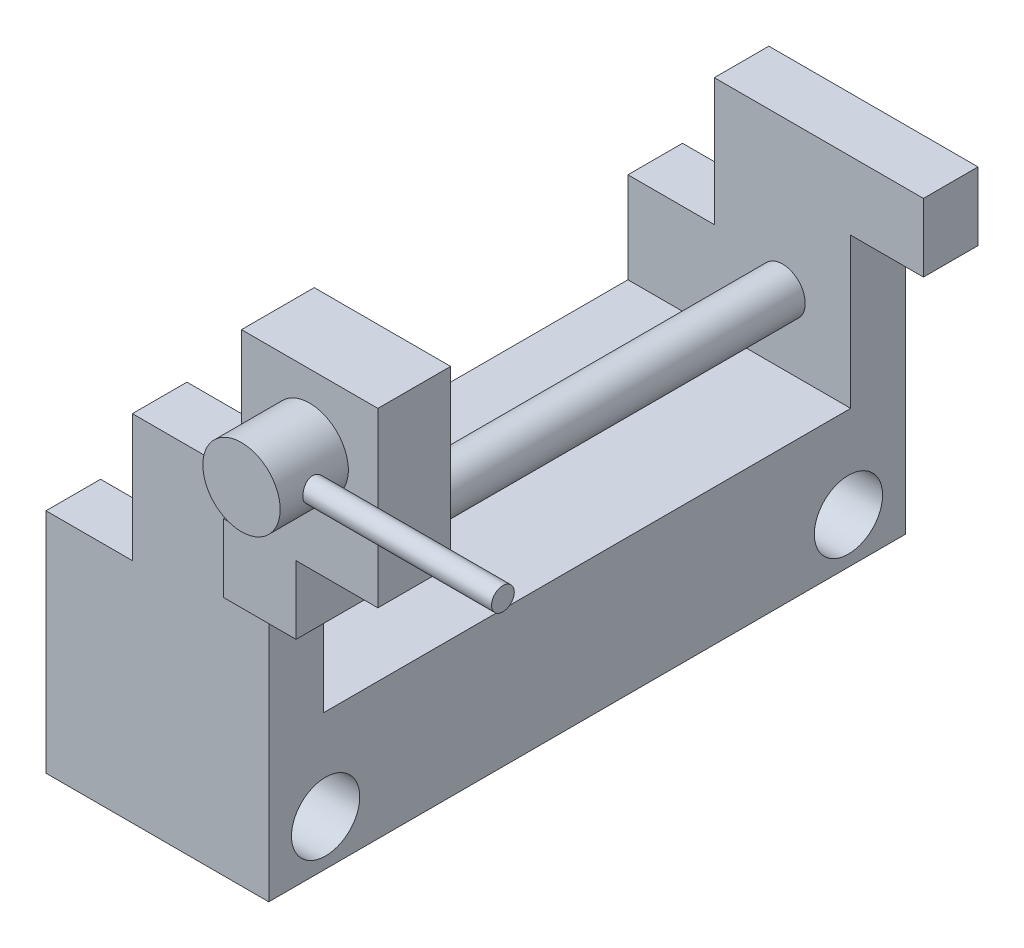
ISO-10303-21;
HEADER;
FILE_DESCRIPTION(('STEP AP214'),'2;1');
FILE_NAME('part.step','',(''),(''),'','','');
FILE_SCHEMA(('AUTOMOTIVE_DESIGN { 1 0 10303 214 1 1 1 1 }'));
ENDSEC;
DATA;
#1=APPLICATION_CONTEXT('core data for automotive mechanical design processes');
#2=APPLICATION_PROTOCOL_DEFINITION('international standard','automotive_design',2000,#1);
#3=PRODUCT_CONTEXT('',#1,'mechanical');
#4=PRODUCT('Part','Part','',(#3));
#5=PRODUCT_RELATED_PRODUCT_CATEGORY('part','',(#4));
#6=PRODUCT_DEFINITION_FORMATION('','',#4);
#7=PRODUCT_DEFINITION_CONTEXT('part definition',#1,'design');
#8=PRODUCT_DEFINITION('design','',#6,#7);
#9=PRODUCT_DEFINITION_SHAPE('','',#8);
#10=(LENGTH_UNIT() NAMED_UNIT(*) SI_UNIT(.MILLI.,.METRE.));
#11=(NAMED_UNIT(*) PLANE_ANGLE_UNIT() SI_UNIT($,.RADIAN.));
#12=(NAMED_UNIT(*) SI_UNIT($,.STERADIAN.) SOLID_ANGLE_UNIT());
#13=UNCERTAINTY_MEASURE_WITH_UNIT(LENGTH_MEASURE(1.E-05),#10,'distance_accuracy_value','');
#14=(GEOMETRIC_REPRESENTATION_CONTEXT(3) GLOBAL_UNCERTAINTY_ASSIGNED_CONTEXT((#13)) GLOBAL_UNIT_ASSIGNED_CONTEXT((#10,
#11,#12)) REPRESENTATION_CONTEXT('',''));
#15=CARTESIAN_POINT('',(0.,0.,0.));
#16=DIRECTION('',(0.,0.,1.));
#17=DIRECTION('',(1.,0.,0.));
#18=AXIS2_PLACEMENT_3D('',#15,#16,#17);
#19=CARTESIAN_POINT('',(-26.8554201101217,3.55207276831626,57.2035545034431));
#20=DIRECTION('',(0.,0.,-1.));
#21=DIRECTION('',(-1.,0.,0.));
#22=AXIS2_PLACEMENT_3D('',#19,#20,#21);
#23=PLANE('',#22);
#24=DIRECTION('',(0.,-1.,0.));
#25=VECTOR('',#24,1.);
#26=CARTESIAN_POINT('',(22.1445798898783,36.5520727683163,57.2035545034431));
#27=LINE('',#26,#25);
#28=CARTESIAN_POINT('',(22.1445798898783,51.5520727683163,57.2035545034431));
#29=VERTEX_POINT('',#28);
#30=CARTESIAN_POINT('',(22.1445798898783,36.5520727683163,57.2035545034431));
#31=VERTEX_POINT('',#30);
#32=EDGE_CURVE('E1438',#29,#31,#27,.T.);
#33=ORIENTED_EDGE('',*,*,#32,.F.);
#34=DIRECTION('',(1.,0.,0.));
#35=VECTOR('',#34,1.);
#36=CARTESIAN_POINT('',(22.1445798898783,51.5520727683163,57.2035545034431));
#37=LINE('',#36,#35);
#38=CARTESIAN_POINT('',(-7.85542011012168,51.5520727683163,57.2035545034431));
#39=VERTEX_POINT('',#38);
#40=EDGE_CURVE('E1504',#39,#29,#37,.T.);
#41=ORIENTED_EDGE('',*,*,#40,.F.);
#42=DIRECTION('',(0.,-1.,0.));
#43=VECTOR('',#42,1.);
#44=CARTESIAN_POINT('',(-7.85542011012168,51.5520727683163,57.2035545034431));
#45=LINE('',#44,#43);
#46=CARTESIAN_POINT('',(-7.85542011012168,23.5520727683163,57.2035545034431));
#47=VERTEX_POINT('',#46);
#48=EDGE_CURVE('E1507',#39,#47,#45,.T.);
#49=ORIENTED_EDGE('',*,*,#48,.T.);
#50=DIRECTION('',(1.,0.,0.));
#51=VECTOR('',#50,1.);
#52=CARTESIAN_POINT('',(-26.8554201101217,23.5520727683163,57.2035545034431));
#53=LINE('',#52,#51);
#54=CARTESIAN_POINT('',(-26.8554201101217,23.5520727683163,57.2035545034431));
#55=VERTEX_POINT('',#54);
#56=EDGE_CURVE('E1534',#55,#47,#53,.T.);
#57=ORIENTED_EDGE('',*,*,#56,.F.);
#58=DIRECTION('',(0.,-1.,0.));
#59=VECTOR('',#58,1.);
#60=CARTESIAN_POINT('',(-26.8554201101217,3.55207276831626,57.2035545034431));
#61=LINE('',#60,#59);
#62=CARTESIAN_POINT('',(-26.8554201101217,-26.4479272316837,57.2035545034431));
#63=VERTEX_POINT('',#62);
#64=EDGE_CURVE('E1568',#55,#63,#61,.T.);
#65=ORIENTED_EDGE('',*,*,#64,.T.);
#66=DIRECTION('',(1.,0.,0.));
#67=VECTOR('',#66,1.);
#68=CARTESIAN_POINT('',(-26.8554201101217,-26.4479272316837,57.2035545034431));
#69=LINE('',#68,#67);
#70=CARTESIAN_POINT('',(22.1445798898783,-26.4479272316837,57.2035545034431));
#71=VERTEX_POINT('',#70);
#72=EDGE_CURVE('E1555',#63,#71,#69,.T.);
#73=ORIENTED_EDGE('',*,*,#72,.T.);
#74=DIRECTION('',(0.,-1.,0.));
#75=VECTOR('',#74,1.);
#76=CARTESIAN_POINT('',(22.1445798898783,3.55207276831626,57.2035545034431));
#77=LINE('',#76,#75);
#78=EDGE_CURVE('E1566',#31,#71,#77,.T.);
#79=ORIENTED_EDGE('',*,*,#78,.F.);
#80=EDGE_LOOP('',(#33,#41,#49,#57,#65,#73,#79));
#81=FACE_BOUND('',#80,.T.);
#82=ADVANCED_FACE('F1240',(#81),#23,.F.);
#83=CARTESIAN_POINT('',(22.1445798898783,3.55207276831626,57.2035545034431));
#84=DIRECTION('',(-1.,0.,0.));
#85=DIRECTION('',(0.,0.,1.));
#86=AXIS2_PLACEMENT_3D('',#83,#84,#85);
#87=PLANE('',#86);
#88=CARTESIAN_POINT('',(22.1445798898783,-16.4479272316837,44.7035545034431));
#89=DIRECTION('',(1.,0.,0.));
#90=DIRECTION('',(0.,0.,-1.));
#91=AXIS2_PLACEMENT_3D('',#88,#89,#90);
#92=CIRCLE('',#91,7.505);
#93=CARTESIAN_POINT('',(22.1445798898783,-16.4479272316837,37.1985545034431));
#94=VERTEX_POINT('',#93);
#95=EDGE_CURVE('E1771',#94,#94,#92,.T.);
#96=ORIENTED_EDGE('',*,*,#95,.F.);
#97=EDGE_LOOP('',(#96));
#98=FACE_BOUND('',#97,.T.);
#99=CARTESIAN_POINT('',(22.1445798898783,-16.4479272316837,-70.2964454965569));
#100=DIRECTION('',(1.,0.,0.));
#101=DIRECTION('',(0.,0.,-1.));
#102=AXIS2_PLACEMENT_3D('',#99,#100,#101);
#103=CIRCLE('',#102,7.505);
#104=CARTESIAN_POINT('',(22.1445798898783,-16.4479272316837,-77.8014454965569));
#105=VERTEX_POINT('',#104);
#106=EDGE_CURVE('E1780',#105,#105,#103,.T.);
#107=ORIENTED_EDGE('',*,*,#106,.F.);
#108=EDGE_LOOP('',(#107));
#109=FACE_BOUND('',#108,.T.);
#110=DIRECTION('',(0.,0.,-1.));
#111=VECTOR('',#110,1.);
#112=CARTESIAN_POINT('',(22.1445798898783,36.5520727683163,-70.7964454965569));
#113=LINE('',#112,#111);
#114=CARTESIAN_POINT('',(22.1445798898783,36.5520727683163,-70.7964454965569));
#115=VERTEX_POINT('',#114);
#116=CARTESIAN_POINT('',(22.1445798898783,36.5520727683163,-82.7964454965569));
#117=VERTEX_POINT('',#116);
#118=EDGE_CURVE('E1453',#115,#117,#113,.T.);
#119=ORIENTED_EDGE('',*,*,#118,.F.);
#120=DIRECTION('',(0.,-1.,0.));
#121=VECTOR('',#120,1.);
#122=CARTESIAN_POINT('',(22.1445798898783,23.5520727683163,-70.7964454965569));
#123=LINE('',#122,#121);
#124=CARTESIAN_POINT('',(22.1445798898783,3.55207276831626,-70.7964454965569));
#125=VERTEX_POINT('',#124);
#126=EDGE_CURVE('E1523',#115,#125,#123,.T.);
#127=ORIENTED_EDGE('',*,*,#126,.T.);
#128=DIRECTION('',(0.,0.,-1.));
#129=VECTOR('',#128,1.);
#130=CARTESIAN_POINT('',(22.1445798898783,3.55207276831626,57.2035545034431));
#131=LINE('',#130,#129);
#132=CARTESIAN_POINT('',(22.1445798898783,3.55207276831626,45.2035545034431));
#133=VERTEX_POINT('',#132);
#134=EDGE_CURVE('E1548',#133,#125,#131,.T.);
#135=ORIENTED_EDGE('',*,*,#134,.F.);
#136=DIRECTION('',(0.,-1.,0.));
#137=VECTOR('',#136,1.);
#138=CARTESIAN_POINT('',(22.1445798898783,23.5520727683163,45.2035545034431));
#139=LINE('',#138,#137);
#140=CARTESIAN_POINT('',(22.1445798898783,36.5520727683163,45.2035545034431));
#141=VERTEX_POINT('',#140);
#142=EDGE_CURVE('E1543',#141,#133,#139,.T.);
#143=ORIENTED_EDGE('',*,*,#142,.F.);
#144=DIRECTION('',(0.,0.,-1.));
#145=VECTOR('',#144,1.);
#146=CARTESIAN_POINT('',(22.1445798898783,36.5520727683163,57.2035545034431));
#147=LINE('',#146,#145);
#148=EDGE_CURVE('E1471',#31,#141,#147,.T.);
#149=ORIENTED_EDGE('',*,*,#148,.F.);
#150=ORIENTED_EDGE('',*,*,#78,.T.);
#151=DIRECTION('',(0.,0.,-1.));
#152=VECTOR('',#151,1.);
#153=CARTESIAN_POINT('',(22.1445798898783,-26.4479272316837,57.2035545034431));
#154=LINE('',#153,#152);
#155=CARTESIAN_POINT('',(22.1445798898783,-26.4479272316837,-82.7964454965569));
#156=VERTEX_POINT('',#155);
#157=EDGE_CURVE('E1558',#71,#156,#154,.T.);
#158=ORIENTED_EDGE('',*,*,#157,.T.);
#159=DIRECTION('',(0.,-1.,0.));
#160=VECTOR('',#159,1.);
#161=CARTESIAN_POINT('',(22.1445798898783,3.55207276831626,-82.7964454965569));
#162=LINE('',#161,#160);
#163=EDGE_CURVE('E1564',#117,#156,#162,.T.);
#164=ORIENTED_EDGE('',*,*,#163,.F.);
#165=EDGE_LOOP('',(#119,#127,#135,#143,#149,#150,#158,#164));
#166=FACE_BOUND('',#165,.T.);
#167=ADVANCED_FACE('F1604',(#98,#109,#166),#87,.F.);
#168=CARTESIAN_POINT('',(-26.8554201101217,23.5520727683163,57.2035545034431));
#169=DIRECTION('',(0.,1.,0.));
#170=DIRECTION('',(0.,0.,1.));
#171=AXIS2_PLACEMENT_3D('',#168,#169,#170);
#172=PLANE('',#171);
#173=DIRECTION('',(1.,0.,0.));
#174=VECTOR('',#173,1.);
#175=CARTESIAN_POINT('',(-26.8554201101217,23.5520727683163,-70.7964454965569));
#176=LINE('',#175,#174);
#177=CARTESIAN_POINT('',(-26.8554201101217,23.5520727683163,-70.7964454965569));
#178=VERTEX_POINT('',#177);
#179=CARTESIAN_POINT('',(-7.85542011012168,23.5520727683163,-70.7964454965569));
#180=VERTEX_POINT('',#179);
#181=EDGE_CURVE('E1519',#178,#180,#176,.T.);
#182=ORIENTED_EDGE('',*,*,#181,.T.);
#183=DIRECTION('',(0.,0.,1.));
#184=VECTOR('',#183,1.);
#185=CARTESIAN_POINT('',(-7.85542011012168,23.5520727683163,-70.7964454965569));
#186=LINE('',#185,#184);
#187=CARTESIAN_POINT('',(-7.85542011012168,23.5520727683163,-82.7964454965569));
#188=VERTEX_POINT('',#187);
#189=EDGE_CURVE('E1484',#188,#180,#186,.T.);
#190=ORIENTED_EDGE('',*,*,#189,.F.);
#191=DIRECTION('',(-1.,0.,0.));
#192=VECTOR('',#191,1.);
#193=CARTESIAN_POINT('',(-26.8554201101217,23.5520727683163,-82.7964454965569));
#194=LINE('',#193,#192);
#195=CARTESIAN_POINT('',(-26.8554201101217,23.5520727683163,-82.7964454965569));
#196=VERTEX_POINT('',#195);
#197=EDGE_CURVE('E1521',#188,#196,#194,.T.);
#198=ORIENTED_EDGE('',*,*,#197,.T.);
#199=DIRECTION('',(0.,0.,1.));
#200=VECTOR('',#199,1.);
#201=CARTESIAN_POINT('',(-26.8554201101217,23.5520727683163,-82.7964454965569));
#202=LINE('',#201,#200);
#203=EDGE_CURVE('E1516',#196,#178,#202,.T.);
#204=ORIENTED_EDGE('',*,*,#203,.T.);
#205=EDGE_LOOP('',(#182,#190,#198,#204));
#206=FACE_BOUND('',#205,.T.);
#207=ADVANCED_FACE('F1609',(#206),#172,.T.);
#208=CARTESIAN_POINT('',(-26.8554201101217,23.5520727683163,57.2035545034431));
#209=DIRECTION('',(0.,-1.,0.));
#210=DIRECTION('',(0.,0.,-1.));
#211=AXIS2_PLACEMENT_3D('',#208,#209,#210);
#212=PLANE('',#211);
#213=DIRECTION('',(0.,0.,1.));
#214=VECTOR('',#213,1.);
#215=CARTESIAN_POINT('',(-7.85542011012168,23.5520727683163,57.2035545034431));
#216=LINE('',#215,#214);
#217=CARTESIAN_POINT('',(-7.85542011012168,23.5520727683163,45.2035545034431));
#218=VERTEX_POINT('',#217);
#219=EDGE_CURVE('E1499',#218,#47,#216,.T.);
#220=ORIENTED_EDGE('',*,*,#219,.F.);
#221=DIRECTION('',(-1.,0.,0.));
#222=VECTOR('',#221,1.);
#223=CARTESIAN_POINT('',(-26.8554201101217,23.5520727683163,45.2035545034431));
#224=LINE('',#223,#222);
#225=CARTESIAN_POINT('',(-26.8554201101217,23.5520727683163,45.2035545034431));
#226=VERTEX_POINT('',#225);
#227=EDGE_CURVE('E1536',#218,#226,#224,.T.);
#228=ORIENTED_EDGE('',*,*,#227,.T.);
#229=DIRECTION('',(0.,0.,1.));
#230=VECTOR('',#229,1.);
#231=CARTESIAN_POINT('',(-26.8554201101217,23.5520727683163,57.2035545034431));
#232=LINE('',#231,#230);
#233=EDGE_CURVE('E1531',#226,#55,#232,.T.);
#234=ORIENTED_EDGE('',*,*,#233,.T.);
#235=ORIENTED_EDGE('',*,*,#56,.T.);
#236=EDGE_LOOP('',(#220,#228,#234,#235));
#237=FACE_BOUND('',#236,.T.);
#238=ADVANCED_FACE('F1625',(#237),#212,.F.);
#239=CARTESIAN_POINT('',(-26.8554201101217,3.55207276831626,57.2035545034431));
#240=DIRECTION('',(0.,-1.,0.));
#241=DIRECTION('',(0.,0.,-1.));
#242=AXIS2_PLACEMENT_3D('',#239,#240,#241);
#243=PLANE('',#242);
#244=DIRECTION('',(1.,0.,0.));
#245=VECTOR('',#244,1.);
#246=CARTESIAN_POINT('',(-26.8554201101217,3.55207276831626,-70.7964454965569));
#247=LINE('',#246,#245);
#248=CARTESIAN_POINT('',(-26.8554201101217,3.55207276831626,-70.7964454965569));
#249=VERTEX_POINT('',#248);
#250=EDGE_CURVE('E1515',#249,#125,#247,.T.);
#251=ORIENTED_EDGE('',*,*,#250,.F.);
#252=DIRECTION('',(0.,0.,1.));
#253=VECTOR('',#252,1.);
#254=CARTESIAN_POINT('',(-26.8554201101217,3.55207276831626,57.2035545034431));
#255=LINE('',#254,#253);
#256=CARTESIAN_POINT('',(-26.8554201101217,3.55207276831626,45.2035545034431));
#257=VERTEX_POINT('',#256);
#258=EDGE_CURVE('E1546',#249,#257,#255,.T.);
#259=ORIENTED_EDGE('',*,*,#258,.T.);
#260=DIRECTION('',(-1.,0.,0.));
#261=VECTOR('',#260,1.);
#262=CARTESIAN_POINT('',(-26.8554201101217,3.55207276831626,45.2035545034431));
#263=LINE('',#262,#261);
#264=EDGE_CURVE('E1530',#133,#257,#263,.T.);
#265=ORIENTED_EDGE('',*,*,#264,.F.);
#266=ORIENTED_EDGE('',*,*,#134,.T.);
#267=EDGE_LOOP('',(#251,#259,#265,#266));
#268=FACE_BOUND('',#267,.T.);
#269=ADVANCED_FACE('F1622',(#268),#243,.F.);
#270=CARTESIAN_POINT('',(-26.8554201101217,3.55207276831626,57.2035545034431));
#271=DIRECTION('',(1.,0.,0.));
#272=DIRECTION('',(0.,0.,-1.));
#273=AXIS2_PLACEMENT_3D('',#270,#271,#272);
#274=PLANE('',#273);
#275=CARTESIAN_POINT('',(-26.8554201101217,-16.4479272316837,44.7035545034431));
#276=DIRECTION('',(1.,0.,0.));
#277=DIRECTION('',(0.,0.,-1.));
#278=AXIS2_PLACEMENT_3D('',#275,#276,#277);
#279=CIRCLE('',#278,7.505);
#280=CARTESIAN_POINT('',(-26.8554201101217,-16.4479272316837,37.1985545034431));
#281=VERTEX_POINT('',#280);
#282=EDGE_CURVE('E1244',#281,#281,#279,.T.);
#283=ORIENTED_EDGE('',*,*,#282,.T.);
#284=EDGE_LOOP('',(#283));
#285=FACE_BOUND('',#284,.T.);
#286=CARTESIAN_POINT('',(-26.8554201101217,-16.4479272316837,-70.2964454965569));
#287=DIRECTION('',(1.,0.,0.));
#288=DIRECTION('',(0.,0.,-1.));
#289=AXIS2_PLACEMENT_3D('',#286,#287,#288);
#290=CIRCLE('',#289,7.505);
#291=CARTESIAN_POINT('',(-26.8554201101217,-16.4479272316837,-77.8014454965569));
#292=VERTEX_POINT('',#291);
#293=EDGE_CURVE('E1774',#292,#292,#290,.T.);
#294=ORIENTED_EDGE('',*,*,#293,.T.);
#295=EDGE_LOOP('',(#294));
#296=FACE_BOUND('',#295,.T.);
#297=DIRECTION('',(0.,0.,1.));
#298=VECTOR('',#297,1.);
#299=CARTESIAN_POINT('',(-26.8554201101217,-26.4479272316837,57.2035545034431));
#300=LINE('',#299,#298);
#301=CARTESIAN_POINT('',(-26.8554201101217,-26.4479272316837,-82.7964454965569));
#302=VERTEX_POINT('',#301);
#303=EDGE_CURVE('E1545',#302,#63,#300,.T.);
#304=ORIENTED_EDGE('',*,*,#303,.T.);
#305=ORIENTED_EDGE('',*,*,#64,.F.);
#306=ORIENTED_EDGE('',*,*,#233,.F.);
#307=DIRECTION('',(0.,-1.,0.));
#308=VECTOR('',#307,1.);
#309=CARTESIAN_POINT('',(-26.8554201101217,23.5520727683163,45.2035545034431));
#310=LINE('',#309,#308);
#311=EDGE_CURVE('E1538',#226,#257,#310,.T.);
#312=ORIENTED_EDGE('',*,*,#311,.T.);
#313=ORIENTED_EDGE('',*,*,#258,.F.);
#314=DIRECTION('',(0.,-1.,0.));
#315=VECTOR('',#314,1.);
#316=CARTESIAN_POINT('',(-26.8554201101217,23.5520727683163,-70.7964454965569));
#317=LINE('',#316,#315);
#318=EDGE_CURVE('E1527',#178,#249,#317,.T.);
#319=ORIENTED_EDGE('',*,*,#318,.F.);
#320=ORIENTED_EDGE('',*,*,#203,.F.);
#321=DIRECTION('',(0.,-1.,0.));
#322=VECTOR('',#321,1.);
#323=CARTESIAN_POINT('',(-26.8554201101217,3.55207276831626,-82.7964454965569));
#324=LINE('',#323,#322);
#325=EDGE_CURVE('E1552',#196,#302,#324,.T.);
#326=ORIENTED_EDGE('',*,*,#325,.T.);
#327=EDGE_LOOP('',(#304,#305,#306,#312,#313,#319,#320,#326));
#328=FACE_BOUND('',#327,.T.);
#329=ADVANCED_FACE('F1242',(#285,#296,#328),#274,.F.);
#330=CARTESIAN_POINT('',(-26.8554201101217,3.55207276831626,-82.7964454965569));
#331=DIRECTION('',(0.,0.,1.));
#332=DIRECTION('',(1.,0.,0.));
#333=AXIS2_PLACEMENT_3D('',#330,#331,#332);
#334=PLANE('',#333);
#335=DIRECTION('',(-1.,0.,0.));
#336=VECTOR('',#335,1.);
#337=CARTESIAN_POINT('',(-26.8554201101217,-26.4479272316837,-82.7964454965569));
#338=LINE('',#337,#336);
#339=EDGE_CURVE('E1549',#156,#302,#338,.T.);
#340=ORIENTED_EDGE('',*,*,#339,.T.);
#341=ORIENTED_EDGE('',*,*,#325,.F.);
#342=ORIENTED_EDGE('',*,*,#197,.F.);
#343=DIRECTION('',(0.,-1.,0.));
#344=VECTOR('',#343,1.);
#345=CARTESIAN_POINT('',(-7.85542011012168,51.5520727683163,-82.7964454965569));
#346=LINE('',#345,#344);
#347=CARTESIAN_POINT('',(-7.85542011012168,51.5520727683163,-82.7964454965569));
#348=VERTEX_POINT('',#347);
#349=EDGE_CURVE('E1496',#348,#188,#346,.T.);
#350=ORIENTED_EDGE('',*,*,#349,.F.);
#351=DIRECTION('',(-1.,0.,0.));
#352=VECTOR('',#351,1.);
#353=CARTESIAN_POINT('',(22.1445798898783,51.5520727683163,-82.7964454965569));
#354=LINE('',#353,#352);
#355=CARTESIAN_POINT('',(38.1445798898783,51.5520727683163,-82.7964454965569));
#356=VERTEX_POINT('',#355);
#357=EDGE_CURVE('E1485',#356,#348,#354,.T.);
#358=ORIENTED_EDGE('',*,*,#357,.F.);
#359=DIRECTION('',(0.,1.,0.));
#360=VECTOR('',#359,1.);
#361=CARTESIAN_POINT('',(38.1445798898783,51.5520727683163,-82.7964454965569));
#362=LINE('',#361,#360);
#363=CARTESIAN_POINT('',(38.1445798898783,36.5520727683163,-82.7964454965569));
#364=VERTEX_POINT('',#363);
#365=EDGE_CURVE('E1459',#364,#356,#362,.T.);
#366=ORIENTED_EDGE('',*,*,#365,.F.);
#367=DIRECTION('',(-1.,0.,0.));
#368=VECTOR('',#367,1.);
#369=CARTESIAN_POINT('',(38.1445798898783,36.5520727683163,-82.7964454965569));
#370=LINE('',#369,#368);
#371=EDGE_CURVE('E1465',#364,#117,#370,.T.);
#372=ORIENTED_EDGE('',*,*,#371,.T.);
#373=ORIENTED_EDGE('',*,*,#163,.T.);
#374=EDGE_LOOP('',(#340,#341,#342,#350,#358,#366,#372,#373));
#375=FACE_BOUND('',#374,.T.);
#376=ADVANCED_FACE('F1613',(#375),#334,.F.);
#377=CARTESIAN_POINT('',(-26.8554201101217,-26.4479272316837,57.2035545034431));
#378=DIRECTION('',(0.,-1.,0.));
#379=DIRECTION('',(0.,0.,-1.));
#380=AXIS2_PLACEMENT_3D('',#377,#378,#379);
#381=PLANE('',#380);
#382=ORIENTED_EDGE('',*,*,#303,.F.);
#383=ORIENTED_EDGE('',*,*,#339,.F.);
#384=ORIENTED_EDGE('',*,*,#157,.F.);
#385=ORIENTED_EDGE('',*,*,#72,.F.);
#386=EDGE_LOOP('',(#382,#383,#384,#385));
#387=FACE_BOUND('',#386,.T.);
#388=ADVANCED_FACE('F1616',(#387),#381,.T.);
#389=CARTESIAN_POINT('',(-26.8554201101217,23.5520727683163,45.2035545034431));
#390=DIRECTION('',(0.,0.,1.));
#391=DIRECTION('',(1.,0.,0.));
#392=AXIS2_PLACEMENT_3D('',#389,#390,#391);
#393=PLANE('',#392);
#394=CARTESIAN_POINT('',(7.14457988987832,18.5520727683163,45.2035545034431));
#395=DIRECTION('',(0.,0.,1.));
#396=DIRECTION('',(1.,0.,0.));
#397=AXIS2_PLACEMENT_3D('',#394,#395,#396);
#398=CIRCLE('',#397,5.);
#399=CARTESIAN_POINT('',(12.1445798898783,18.5520727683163,45.2035545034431));
#400=VERTEX_POINT('',#399);
#401=EDGE_CURVE('E12',#400,#400,#398,.F.);
#402=ORIENTED_EDGE('',*,*,#401,.F.);
#403=EDGE_LOOP('',(#402));
#404=FACE_BOUND('',#403,.T.);
#405=ORIENTED_EDGE('',*,*,#264,.T.);
#406=ORIENTED_EDGE('',*,*,#311,.F.);
#407=ORIENTED_EDGE('',*,*,#227,.F.);
#408=DIRECTION('',(0.,-1.,0.));
#409=VECTOR('',#408,1.);
#410=CARTESIAN_POINT('',(-7.85542011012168,51.5520727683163,45.2035545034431));
#411=LINE('',#410,#409);
#412=CARTESIAN_POINT('',(-7.85542011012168,51.5520727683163,45.2035545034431));
#413=VERTEX_POINT('',#412);
#414=EDGE_CURVE('E1512',#413,#218,#411,.T.);
#415=ORIENTED_EDGE('',*,*,#414,.F.);
#416=DIRECTION('',(-1.,0.,0.));
#417=VECTOR('',#416,1.);
#418=CARTESIAN_POINT('',(22.1445798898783,51.5520727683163,45.2035545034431));
#419=LINE('',#418,#417);
#420=CARTESIAN_POINT('',(38.1445798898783,51.5520727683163,45.2035545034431));
#421=VERTEX_POINT('',#420);
#422=EDGE_CURVE('E1500',#421,#413,#419,.T.);
#423=ORIENTED_EDGE('',*,*,#422,.F.);
#424=DIRECTION('',(0.,1.,0.));
#425=VECTOR('',#424,1.);
#426=CARTESIAN_POINT('',(38.1445798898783,51.5520727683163,45.2035545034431));
#427=LINE('',#426,#425);
#428=CARTESIAN_POINT('',(38.1445798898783,36.5520727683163,45.2035545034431));
#429=VERTEX_POINT('',#428);
#430=EDGE_CURVE('E1474',#429,#421,#427,.T.);
#431=ORIENTED_EDGE('',*,*,#430,.F.);
#432=DIRECTION('',(-1.,0.,0.));
#433=VECTOR('',#432,1.);
#434=CARTESIAN_POINT('',(38.1445798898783,36.5520727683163,45.2035545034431));
#435=LINE('',#434,#433);
#436=EDGE_CURVE('E1479',#429,#141,#435,.T.);
#437=ORIENTED_EDGE('',*,*,#436,.T.);
#438=ORIENTED_EDGE('',*,*,#142,.T.);
#439=EDGE_LOOP('',(#405,#406,#407,#415,#423,#431,#437,#438));
#440=FACE_BOUND('',#439,.T.);
#441=ADVANCED_FACE('F1620',(#404,#440),#393,.F.);
#442=CARTESIAN_POINT('',(-26.8554201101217,23.5520727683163,-70.7964454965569));
#443=DIRECTION('',(0.,0.,-1.));
#444=DIRECTION('',(-1.,0.,0.));
#445=AXIS2_PLACEMENT_3D('',#442,#443,#444);
#446=PLANE('',#445);
#447=CARTESIAN_POINT('',(7.14457988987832,18.5520727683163,-70.7964454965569));
#448=DIRECTION('',(0.,0.,-1.));
#449=DIRECTION('',(-1.,0.,0.));
#450=AXIS2_PLACEMENT_3D('',#447,#448,#449);
#451=CIRCLE('',#450,5.);
#452=CARTESIAN_POINT('',(2.14457988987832,18.5520727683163,-70.7964454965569));
#453=VERTEX_POINT('',#452);
#454=EDGE_CURVE('E1249',#453,#453,#451,.F.);
#455=ORIENTED_EDGE('',*,*,#454,.F.);
#456=EDGE_LOOP('',(#455));
#457=FACE_BOUND('',#456,.T.);
#458=ORIENTED_EDGE('',*,*,#250,.T.);
#459=ORIENTED_EDGE('',*,*,#126,.F.);
#460=DIRECTION('',(-1.,0.,0.));
#461=VECTOR('',#460,1.);
#462=CARTESIAN_POINT('',(38.1445798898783,36.5520727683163,-70.7964454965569));
#463=LINE('',#462,#461);
#464=CARTESIAN_POINT('',(38.1445798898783,36.5520727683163,-70.7964454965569));
#465=VERTEX_POINT('',#464);
#466=EDGE_CURVE('E1469',#465,#115,#463,.T.);
#467=ORIENTED_EDGE('',*,*,#466,.F.);
#468=DIRECTION('',(0.,-1.,0.));
#469=VECTOR('',#468,1.);
#470=CARTESIAN_POINT('',(38.1445798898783,51.5520727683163,-70.7964454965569));
#471=LINE('',#470,#469);
#472=CARTESIAN_POINT('',(38.1445798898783,51.5520727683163,-70.7964454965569));
#473=VERTEX_POINT('',#472);
#474=EDGE_CURVE('E1454',#473,#465,#471,.T.);
#475=ORIENTED_EDGE('',*,*,#474,.F.);
#476=DIRECTION('',(1.,0.,0.));
#477=VECTOR('',#476,1.);
#478=CARTESIAN_POINT('',(22.1445798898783,51.5520727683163,-70.7964454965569));
#479=LINE('',#478,#477);
#480=CARTESIAN_POINT('',(-7.85542011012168,51.5520727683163,-70.7964454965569));
#481=VERTEX_POINT('',#480);
#482=EDGE_CURVE('E1489',#481,#473,#479,.T.);
#483=ORIENTED_EDGE('',*,*,#482,.F.);
#484=DIRECTION('',(0.,-1.,0.));
#485=VECTOR('',#484,1.);
#486=CARTESIAN_POINT('',(-7.85542011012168,51.5520727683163,-70.7964454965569));
#487=LINE('',#486,#485);
#488=EDGE_CURVE('E1491',#481,#180,#487,.T.);
#489=ORIENTED_EDGE('',*,*,#488,.T.);
#490=ORIENTED_EDGE('',*,*,#181,.F.);
#491=ORIENTED_EDGE('',*,*,#318,.T.);
#492=EDGE_LOOP('',(#458,#459,#467,#475,#483,#489,#490,#491));
#493=FACE_BOUND('',#492,.T.);
#494=ADVANCED_FACE('F1629',(#457,#493),#446,.F.);
#495=CARTESIAN_POINT('',(-7.85542011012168,51.5520727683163,57.2035545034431));
#496=DIRECTION('',(1.,0.,0.));
#497=DIRECTION('',(0.,0.,-1.));
#498=AXIS2_PLACEMENT_3D('',#495,#496,#497);
#499=PLANE('',#498);
#500=ORIENTED_EDGE('',*,*,#219,.T.);
#501=ORIENTED_EDGE('',*,*,#48,.F.);
#502=DIRECTION('',(0.,0.,1.));
#503=VECTOR('',#502,1.);
#504=CARTESIAN_POINT('',(-7.85542011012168,51.5520727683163,57.2035545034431));
#505=LINE('',#504,#503);
#506=EDGE_CURVE('E1502',#413,#39,#505,.T.);
#507=ORIENTED_EDGE('',*,*,#506,.F.);
#508=ORIENTED_EDGE('',*,*,#414,.T.);
#509=EDGE_LOOP('',(#500,#501,#507,#508));
#510=FACE_BOUND('',#509,.T.);
#511=ADVANCED_FACE('F1636',(#510),#499,.F.);
#512=CARTESIAN_POINT('',(-26.8554201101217,51.5520727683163,57.2035545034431));
#513=DIRECTION('',(0.,1.,0.));
#514=DIRECTION('',(0.,0.,1.));
#515=AXIS2_PLACEMENT_3D('',#512,#513,#514);
#516=PLANE('',#515);
#517=DIRECTION('',(0.,0.,1.));
#518=VECTOR('',#517,1.);
#519=CARTESIAN_POINT('',(26.1445798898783,51.5520727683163,67.2035545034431));
#520=LINE('',#519,#518);
#521=CARTESIAN_POINT('',(26.1445798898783,51.5520727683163,51.2035545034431));
#522=VERTEX_POINT('',#521);
#523=CARTESIAN_POINT('',(26.1445798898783,51.5520727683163,67.2035545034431));
#524=VERTEX_POINT('',#523);
#525=EDGE_CURVE('E1420',#522,#524,#520,.T.);
#526=ORIENTED_EDGE('',*,*,#525,.F.);
#527=DIRECTION('',(-1.,0.,0.));
#528=VECTOR('',#527,1.);
#529=CARTESIAN_POINT('',(38.1445798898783,51.5520727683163,51.2035545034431));
#530=LINE('',#529,#528);
#531=CARTESIAN_POINT('',(38.1445798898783,51.5520727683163,51.2035545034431));
#532=VERTEX_POINT('',#531);
#533=EDGE_CURVE('E1417',#532,#522,#530,.T.);
#534=ORIENTED_EDGE('',*,*,#533,.F.);
#535=DIRECTION('',(0.,0.,1.));
#536=VECTOR('',#535,1.);
#537=CARTESIAN_POINT('',(38.1445798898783,51.5520727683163,57.2035545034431));
#538=LINE('',#537,#536);
#539=EDGE_CURVE('E1477',#421,#532,#538,.T.);
#540=ORIENTED_EDGE('',*,*,#539,.F.);
#541=ORIENTED_EDGE('',*,*,#422,.T.);
#542=ORIENTED_EDGE('',*,*,#506,.T.);
#543=ORIENTED_EDGE('',*,*,#40,.T.);
#544=DIRECTION('',(0.,0.,-1.));
#545=VECTOR('',#544,1.);
#546=CARTESIAN_POINT('',(22.1445798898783,51.5520727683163,67.2035545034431));
#547=LINE('',#546,#545);
#548=CARTESIAN_POINT('',(22.1445798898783,51.5520727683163,67.2035545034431));
#549=VERTEX_POINT('',#548);
#550=EDGE_CURVE('E1445',#549,#29,#547,.T.);
#551=ORIENTED_EDGE('',*,*,#550,.F.);
#552=DIRECTION('',(-1.,0.,0.));
#553=VECTOR('',#552,1.);
#554=CARTESIAN_POINT('',(22.1445798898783,51.5520727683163,67.2035545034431));
#555=LINE('',#554,#553);
#556=EDGE_CURVE('E1265',#524,#549,#555,.T.);
#557=ORIENTED_EDGE('',*,*,#556,.F.);
#558=EDGE_LOOP('',(#526,#534,#540,#541,#542,#543,#551,#557));
#559=FACE_BOUND('',#558,.T.);
#560=ADVANCED_FACE('F1643',(#559),#516,.T.);
#561=CARTESIAN_POINT('',(-7.85542011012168,51.5520727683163,-70.7964454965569));
#562=DIRECTION('',(1.,0.,0.));
#563=DIRECTION('',(0.,0.,-1.));
#564=AXIS2_PLACEMENT_3D('',#561,#562,#563);
#565=PLANE('',#564);
#566=ORIENTED_EDGE('',*,*,#189,.T.);
#567=ORIENTED_EDGE('',*,*,#488,.F.);
#568=DIRECTION('',(0.,0.,1.));
#569=VECTOR('',#568,1.);
#570=CARTESIAN_POINT('',(-7.85542011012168,51.5520727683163,-70.7964454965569));
#571=LINE('',#570,#569);
#572=EDGE_CURVE('E1487',#348,#481,#571,.T.);
#573=ORIENTED_EDGE('',*,*,#572,.F.);
#574=ORIENTED_EDGE('',*,*,#349,.T.);
#575=EDGE_LOOP('',(#566,#567,#573,#574));
#576=FACE_BOUND('',#575,.T.);
#577=ADVANCED_FACE('F1647',(#576),#565,.F.);
#578=CARTESIAN_POINT('',(-26.8554201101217,51.5520727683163,57.2035545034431));
#579=DIRECTION('',(0.,1.,0.));
#580=DIRECTION('',(0.,0.,1.));
#581=AXIS2_PLACEMENT_3D('',#578,#579,#580);
#582=PLANE('',#581);
#583=ORIENTED_EDGE('',*,*,#482,.T.);
#584=DIRECTION('',(0.,0.,1.));
#585=VECTOR('',#584,1.);
#586=CARTESIAN_POINT('',(38.1445798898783,51.5520727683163,-70.7964454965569));
#587=LINE('',#586,#585);
#588=EDGE_CURVE('E1462',#356,#473,#587,.T.);
#589=ORIENTED_EDGE('',*,*,#588,.F.);
#590=ORIENTED_EDGE('',*,*,#357,.T.);
#591=ORIENTED_EDGE('',*,*,#572,.T.);
#592=EDGE_LOOP('',(#583,#589,#590,#591));
#593=FACE_BOUND('',#592,.T.);
#594=ADVANCED_FACE('F1650',(#593),#582,.T.);
#595=CARTESIAN_POINT('',(38.1445798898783,36.5520727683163,57.2035545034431));
#596=DIRECTION('',(0.,1.,0.));
#597=DIRECTION('',(0.,0.,1.));
#598=AXIS2_PLACEMENT_3D('',#595,#596,#597);
#599=PLANE('',#598);
#600=ORIENTED_EDGE('',*,*,#148,.T.);
#601=ORIENTED_EDGE('',*,*,#436,.F.);
#602=DIRECTION('',(0.,0.,-1.));
#603=VECTOR('',#602,1.);
#604=CARTESIAN_POINT('',(38.1445798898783,36.5520727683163,57.2035545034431));
#605=LINE('',#604,#603);
#606=CARTESIAN_POINT('',(38.1445798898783,36.5520727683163,67.2035545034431));
#607=VERTEX_POINT('',#606);
#608=EDGE_CURVE('E1472',#607,#429,#605,.T.);
#609=ORIENTED_EDGE('',*,*,#608,.F.);
#610=DIRECTION('',(1.,0.,0.));
#611=VECTOR('',#610,1.);
#612=CARTESIAN_POINT('',(22.1445798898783,36.5520727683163,67.2035545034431));
#613=LINE('',#612,#611);
#614=CARTESIAN_POINT('',(22.1445798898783,36.5520727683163,67.2035545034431));
#615=VERTEX_POINT('',#614);
#616=EDGE_CURVE('E1441',#615,#607,#613,.T.);
#617=ORIENTED_EDGE('',*,*,#616,.F.);
#618=DIRECTION('',(0.,0.,-1.));
#619=VECTOR('',#618,1.);
#620=CARTESIAN_POINT('',(22.1445798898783,36.5520727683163,67.2035545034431));
#621=LINE('',#620,#619);
#622=EDGE_CURVE('E1450',#615,#31,#621,.T.);
#623=ORIENTED_EDGE('',*,*,#622,.T.);
#624=EDGE_LOOP('',(#600,#601,#609,#617,#623));
#625=FACE_BOUND('',#624,.T.);
#626=ADVANCED_FACE('F1654',(#625),#599,.F.);
#627=CARTESIAN_POINT('',(38.1445798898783,-26.4479272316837,57.2035545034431));
#628=DIRECTION('',(1.,0.,0.));
#629=DIRECTION('',(0.,0.,-1.));
#630=AXIS2_PLACEMENT_3D('',#627,#628,#629);
#631=PLANE('',#630);
#632=DIRECTION('',(0.,0.,-1.));
#633=VECTOR('',#632,1.);
#634=CARTESIAN_POINT('',(38.1445798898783,51.5520727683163,67.2035545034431));
#635=LINE('',#634,#633);
#636=CARTESIAN_POINT('',(38.1445798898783,51.5520727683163,67.2035545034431));
#637=VERTEX_POINT('',#636);
#638=EDGE_CURVE('E1257',#637,#532,#635,.T.);
#639=ORIENTED_EDGE('',*,*,#638,.F.);
#640=DIRECTION('',(0.,1.,0.));
#641=VECTOR('',#640,1.);
#642=CARTESIAN_POINT('',(38.1445798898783,36.5520727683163,67.2035545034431));
#643=LINE('',#642,#641);
#644=EDGE_CURVE('E1416',#607,#637,#643,.T.);
#645=ORIENTED_EDGE('',*,*,#644,.F.);
#646=ORIENTED_EDGE('',*,*,#608,.T.);
#647=ORIENTED_EDGE('',*,*,#430,.T.);
#648=ORIENTED_EDGE('',*,*,#539,.T.);
#649=EDGE_LOOP('',(#639,#645,#646,#647,#648));
#650=FACE_BOUND('',#649,.T.);
#651=ADVANCED_FACE('F1658',(#650),#631,.T.);
#652=CARTESIAN_POINT('',(38.1445798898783,36.5520727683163,-70.7964454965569));
#653=DIRECTION('',(0.,1.,0.));
#654=DIRECTION('',(0.,0.,1.));
#655=AXIS2_PLACEMENT_3D('',#652,#653,#654);
#656=PLANE('',#655);
#657=ORIENTED_EDGE('',*,*,#118,.T.);
#658=ORIENTED_EDGE('',*,*,#371,.F.);
#659=DIRECTION('',(0.,0.,-1.));
#660=VECTOR('',#659,1.);
#661=CARTESIAN_POINT('',(38.1445798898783,36.5520727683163,-70.7964454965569));
#662=LINE('',#661,#660);
#663=EDGE_CURVE('E1457',#465,#364,#662,.T.);
#664=ORIENTED_EDGE('',*,*,#663,.F.);
#665=ORIENTED_EDGE('',*,*,#466,.T.);
#666=EDGE_LOOP('',(#657,#658,#664,#665));
#667=FACE_BOUND('',#666,.T.);
#668=ADVANCED_FACE('F1662',(#667),#656,.F.);
#669=CARTESIAN_POINT('',(38.1445798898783,-26.4479272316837,57.2035545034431));
#670=DIRECTION('',(1.,0.,0.));
#671=DIRECTION('',(0.,0.,-1.));
#672=AXIS2_PLACEMENT_3D('',#669,#670,#671);
#673=PLANE('',#672);
#674=ORIENTED_EDGE('',*,*,#474,.T.);
#675=ORIENTED_EDGE('',*,*,#663,.T.);
#676=ORIENTED_EDGE('',*,*,#365,.T.);
#677=ORIENTED_EDGE('',*,*,#588,.T.);
#678=EDGE_LOOP('',(#674,#675,#676,#677));
#679=FACE_BOUND('',#678,.T.);
#680=ADVANCED_FACE('F1665',(#679),#673,.T.);
#681=CARTESIAN_POINT('',(22.1445798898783,36.5520727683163,67.2035545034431));
#682=DIRECTION('',(1.,0.,0.));
#683=DIRECTION('',(0.,0.,-1.));
#684=AXIS2_PLACEMENT_3D('',#681,#682,#683);
#685=PLANE('',#684);
#686=ORIENTED_EDGE('',*,*,#32,.T.);
#687=ORIENTED_EDGE('',*,*,#622,.F.);
#688=DIRECTION('',(0.,-1.,0.));
#689=VECTOR('',#688,1.);
#690=CARTESIAN_POINT('',(22.1445798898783,36.5520727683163,67.2035545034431));
#691=LINE('',#690,#689);
#692=EDGE_CURVE('E1439',#549,#615,#691,.T.);
#693=ORIENTED_EDGE('',*,*,#692,.F.);
#694=ORIENTED_EDGE('',*,*,#550,.T.);
#695=EDGE_LOOP('',(#686,#687,#693,#694));
#696=FACE_BOUND('',#695,.T.);
#697=ADVANCED_FACE('F1669',(#696),#685,.F.);
#698=CARTESIAN_POINT('',(-26.8554201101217,-26.4479272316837,67.2035545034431));
#699=DIRECTION('',(0.,0.,-1.));
#700=DIRECTION('',(-1.,0.,0.));
#701=AXIS2_PLACEMENT_3D('',#698,#699,#700);
#702=PLANE('',#701);
#703=CARTESIAN_POINT('',(41.1445798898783,74.5520727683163,67.2035545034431));
#704=DIRECTION('',(0.,0.,-1.));
#705=DIRECTION('',(-1.,0.,0.));
#706=AXIS2_PLACEMENT_3D('',#703,#704,#705);
#707=CIRCLE('',#706,8.5);
#708=CARTESIAN_POINT('',(32.6445798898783,74.5520727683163,67.2035545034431));
#709=VERTEX_POINT('',#708);
#710=EDGE_CURVE('E1571',#709,#709,#707,.F.);
#711=ORIENTED_EDGE('',*,*,#710,.F.);
#712=EDGE_LOOP('',(#711));
#713=FACE_BOUND('',#712,.T.);
#714=ORIENTED_EDGE('',*,*,#692,.T.);
#715=ORIENTED_EDGE('',*,*,#616,.T.);
#716=ORIENTED_EDGE('',*,*,#644,.T.);
#717=DIRECTION('',(-1.,0.,0.));
#718=VECTOR('',#717,1.);
#719=CARTESIAN_POINT('',(56.1445798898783,51.5520727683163,67.2035545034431));
#720=LINE('',#719,#718);
#721=CARTESIAN_POINT('',(56.1445798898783,51.5520727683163,67.2035545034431));
#722=VERTEX_POINT('',#721);
#723=EDGE_CURVE('E1396',#722,#637,#720,.T.);
#724=ORIENTED_EDGE('',*,*,#723,.F.);
#725=DIRECTION('',(0.,-1.,0.));
#726=VECTOR('',#725,1.);
#727=CARTESIAN_POINT('',(56.1445798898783,89.5520727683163,67.2035545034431));
#728=LINE('',#727,#726);
#729=CARTESIAN_POINT('',(56.1445798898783,89.5520727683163,67.2035545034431));
#730=VERTEX_POINT('',#729);
#731=EDGE_CURVE('E1403',#730,#722,#728,.T.);
#732=ORIENTED_EDGE('',*,*,#731,.F.);
#733=DIRECTION('',(1.,0.,0.));
#734=VECTOR('',#733,1.);
#735=CARTESIAN_POINT('',(38.1445798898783,89.5520727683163,67.2035545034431));
#736=LINE('',#735,#734);
#737=CARTESIAN_POINT('',(26.1445798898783,89.5520727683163,67.2035545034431));
#738=VERTEX_POINT('',#737);
#739=EDGE_CURVE('E1429',#738,#730,#736,.T.);
#740=ORIENTED_EDGE('',*,*,#739,.F.);
#741=DIRECTION('',(0.,-1.,0.));
#742=VECTOR('',#741,1.);
#743=CARTESIAN_POINT('',(26.1445798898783,89.5520727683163,67.2035545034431));
#744=LINE('',#743,#742);
#745=EDGE_CURVE('E1430',#738,#524,#744,.T.);
#746=ORIENTED_EDGE('',*,*,#745,.T.);
#747=ORIENTED_EDGE('',*,*,#556,.T.);
#748=EDGE_LOOP('',(#714,#715,#716,#724,#732,#740,#746,#747));
#749=FACE_BOUND('',#748,.T.);
#750=ADVANCED_FACE('F1414',(#713,#749),#702,.F.);
#751=CARTESIAN_POINT('',(38.1445798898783,89.5520727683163,51.2035545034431));
#752=DIRECTION('',(0.,0.,1.));
#753=DIRECTION('',(1.,0.,0.));
#754=AXIS2_PLACEMENT_3D('',#751,#752,#753);
#755=PLANE('',#754);
#756=ORIENTED_EDGE('',*,*,#533,.T.);
#757=DIRECTION('',(0.,-1.,0.));
#758=VECTOR('',#757,1.);
#759=CARTESIAN_POINT('',(26.1445798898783,89.5520727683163,51.2035545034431));
#760=LINE('',#759,#758);
#761=CARTESIAN_POINT('',(26.1445798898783,89.5520727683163,51.2035545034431));
#762=VERTEX_POINT('',#761);
#763=EDGE_CURVE('E1435',#762,#522,#760,.T.);
#764=ORIENTED_EDGE('',*,*,#763,.F.);
#765=DIRECTION('',(-1.,0.,0.));
#766=VECTOR('',#765,1.);
#767=CARTESIAN_POINT('',(38.1445798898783,89.5520727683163,51.2035545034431));
#768=LINE('',#767,#766);
#769=CARTESIAN_POINT('',(56.1445798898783,89.5520727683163,51.2035545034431));
#770=VERTEX_POINT('',#769);
#771=EDGE_CURVE('E1425',#770,#762,#768,.T.);
#772=ORIENTED_EDGE('',*,*,#771,.F.);
#773=DIRECTION('',(0.,1.,0.));
#774=VECTOR('',#773,1.);
#775=CARTESIAN_POINT('',(56.1445798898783,89.5520727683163,51.2035545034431));
#776=LINE('',#775,#774);
#777=CARTESIAN_POINT('',(56.1445798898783,51.5520727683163,51.2035545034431));
#778=VERTEX_POINT('',#777);
#779=EDGE_CURVE('E1402',#778,#770,#776,.T.);
#780=ORIENTED_EDGE('',*,*,#779,.F.);
#781=DIRECTION('',(-1.,0.,0.));
#782=VECTOR('',#781,1.);
#783=CARTESIAN_POINT('',(56.1445798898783,51.5520727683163,51.2035545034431));
#784=LINE('',#783,#782);
#785=EDGE_CURVE('E1398',#778,#532,#784,.T.);
#786=ORIENTED_EDGE('',*,*,#785,.T.);
#787=EDGE_LOOP('',(#756,#764,#772,#780,#786));
#788=FACE_BOUND('',#787,.T.);
#789=ADVANCED_FACE('F1676',(#788),#755,.F.);
#790=CARTESIAN_POINT('',(26.1445798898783,89.5520727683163,67.2035545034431));
#791=DIRECTION('',(1.,0.,0.));
#792=DIRECTION('',(0.,0.,-1.));
#793=AXIS2_PLACEMENT_3D('',#790,#791,#792);
#794=PLANE('',#793);
#795=ORIENTED_EDGE('',*,*,#525,.T.);
#796=ORIENTED_EDGE('',*,*,#745,.F.);
#797=DIRECTION('',(0.,0.,1.));
#798=VECTOR('',#797,1.);
#799=CARTESIAN_POINT('',(26.1445798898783,89.5520727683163,67.2035545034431));
#800=LINE('',#799,#798);
#801=EDGE_CURVE('E1427',#762,#738,#800,.T.);
#802=ORIENTED_EDGE('',*,*,#801,.F.);
#803=ORIENTED_EDGE('',*,*,#763,.T.);
#804=EDGE_LOOP('',(#795,#796,#802,#803));
#805=FACE_BOUND('',#804,.T.);
#806=ADVANCED_FACE('F1680',(#805),#794,.F.);
#807=CARTESIAN_POINT('',(-26.8554201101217,89.5520727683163,57.2035545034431));
#808=DIRECTION('',(0.,1.,0.));
#809=DIRECTION('',(0.,0.,1.));
#810=AXIS2_PLACEMENT_3D('',#807,#808,#809);
#811=PLANE('',#810);
#812=ORIENTED_EDGE('',*,*,#739,.T.);
#813=DIRECTION('',(0.,0.,1.));
#814=VECTOR('',#813,1.);
#815=CARTESIAN_POINT('',(56.1445798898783,89.5520727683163,67.2035545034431));
#816=LINE('',#815,#814);
#817=EDGE_CURVE('E1409',#770,#730,#816,.T.);
#818=ORIENTED_EDGE('',*,*,#817,.F.);
#819=ORIENTED_EDGE('',*,*,#771,.T.);
#820=ORIENTED_EDGE('',*,*,#801,.T.);
#821=EDGE_LOOP('',(#812,#818,#819,#820));
#822=FACE_BOUND('',#821,.T.);
#823=ADVANCED_FACE('F1684',(#822),#811,.T.);
#824=CARTESIAN_POINT('',(56.1445798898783,51.5520727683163,67.2035545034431));
#825=DIRECTION('',(0.,1.,0.));
#826=DIRECTION('',(0.,0.,1.));
#827=AXIS2_PLACEMENT_3D('',#824,#825,#826);
#828=PLANE('',#827);
#829=ORIENTED_EDGE('',*,*,#638,.T.);
#830=ORIENTED_EDGE('',*,*,#785,.F.);
#831=DIRECTION('',(0.,0.,-1.));
#832=VECTOR('',#831,1.);
#833=CARTESIAN_POINT('',(56.1445798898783,51.5520727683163,67.2035545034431));
#834=LINE('',#833,#832);
#835=EDGE_CURVE('E1392',#722,#778,#834,.T.);
#836=ORIENTED_EDGE('',*,*,#835,.F.);
#837=ORIENTED_EDGE('',*,*,#723,.T.);
#838=EDGE_LOOP('',(#829,#830,#836,#837));
#839=FACE_BOUND('',#838,.T.);
#840=ADVANCED_FACE('F1394',(#839),#828,.F.);
#841=CARTESIAN_POINT('',(56.1445798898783,-26.4479272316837,57.2035545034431));
#842=DIRECTION('',(1.,0.,0.));
#843=DIRECTION('',(0.,0.,-1.));
#844=AXIS2_PLACEMENT_3D('',#841,#842,#843);
#845=PLANE('',#844);
#846=ORIENTED_EDGE('',*,*,#731,.T.);
#847=ORIENTED_EDGE('',*,*,#835,.T.);
#848=ORIENTED_EDGE('',*,*,#779,.T.);
#849=ORIENTED_EDGE('',*,*,#817,.T.);
#850=EDGE_LOOP('',(#846,#847,#848,#849));
#851=FACE_BOUND('',#850,.T.);
#852=ADVANCED_FACE('F1407',(#851),#845,.T.);
#853=CARTESIAN_POINT('',(41.1445798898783,74.5520727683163,82.2035545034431));
#854=DIRECTION('',(0.,0.,-1.));
#855=DIRECTION('',(-1.,0.,0.));
#856=AXIS2_PLACEMENT_3D('',#853,#854,#855);
#857=CYLINDRICAL_SURFACE('',#856,8.5);
#858=CARTESIAN_POINT('',(49.6445798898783,74.5520727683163,77.2035545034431));
#859=CARTESIAN_POINT('',(49.6445785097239,74.6893438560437,77.2035525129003));
#860=CARTESIAN_POINT('',(49.6412226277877,74.8266351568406,77.1922109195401));
#861=CARTESIAN_POINT('',(49.6281628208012,75.0972275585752,77.1472467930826));
#862=CARTESIAN_POINT('',(49.6184567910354,75.2305273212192,77.1136168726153));
#863=CARTESIAN_POINT('',(49.5937616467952,75.4891941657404,77.0252903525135));
#864=CARTESIAN_POINT('',(49.5787801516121,75.6145723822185,76.9706241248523));
#865=CARTESIAN_POINT('',(49.5450959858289,75.8543829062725,76.8418991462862));
#866=CARTESIAN_POINT('',(49.5263928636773,75.9688138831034,76.7678380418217));
#867=CARTESIAN_POINT('',(49.4866854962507,76.1866519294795,76.6002627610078));
#868=CARTESIAN_POINT('',(49.4656354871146,76.28971279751,76.5063094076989));
#869=CARTESIAN_POINT('',(49.4238835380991,76.478866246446,76.3025531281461));
#870=CARTESIAN_POINT('',(49.4031816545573,76.5649561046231,76.1927476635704));
#871=CARTESIAN_POINT('',(49.3639887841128,76.719520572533,75.9575055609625));
#872=CARTESIAN_POINT('',(49.3455548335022,76.787577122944,75.8317838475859));
#873=CARTESIAN_POINT('',(49.3136669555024,76.9014424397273,75.5700507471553));
#874=CARTESIAN_POINT('',(49.3002118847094,76.9472563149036,75.4340417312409));
#875=CARTESIAN_POINT('',(49.2802812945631,77.0140958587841,75.1594730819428));
#876=CARTESIAN_POINT('',(49.2736269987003,77.0357579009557,75.021081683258));
#877=CARTESIAN_POINT('',(49.2675191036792,77.0556655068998,74.7424813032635));
#878=CARTESIAN_POINT('',(49.2680638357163,77.0539164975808,74.6022727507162));
#879=CARTESIAN_POINT('',(49.2761337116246,77.027552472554,74.3291535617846));
#880=CARTESIAN_POINT('',(49.2834170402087,77.0037295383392,74.1961581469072));
#881=CARTESIAN_POINT('',(49.3037529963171,76.9351715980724,73.9361417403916));
#882=CARTESIAN_POINT('',(49.3168061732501,76.8904346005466,73.8091213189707));
#883=CARTESIAN_POINT('',(49.3474076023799,76.7807238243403,73.5626998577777));
#884=CARTESIAN_POINT('',(49.3650132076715,76.7154893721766,73.4434222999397));
#885=CARTESIAN_POINT('',(49.4027076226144,76.5668167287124,73.2172391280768));
#886=CARTESIAN_POINT('',(49.4227970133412,76.4833742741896,73.1103364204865));
#887=CARTESIAN_POINT('',(49.4641809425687,76.2966989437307,72.9074386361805));
#888=CARTESIAN_POINT('',(49.4854915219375,76.1928072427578,72.8120519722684));
#889=CARTESIAN_POINT('',(49.5262020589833,75.9702373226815,72.6399164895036));
#890=CARTESIAN_POINT('',(49.5456019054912,75.8515582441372,72.5631687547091));
#891=CARTESIAN_POINT('',(49.5804708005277,75.6017070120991,72.4301394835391));
#892=CARTESIAN_POINT('',(49.5959146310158,75.4704616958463,72.3739883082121));
#893=CARTESIAN_POINT('',(49.6209496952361,75.1998316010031,72.2847334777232));
#894=CARTESIAN_POINT('',(49.6305424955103,75.0604490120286,72.2516236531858));
#895=CARTESIAN_POINT('',(49.6425488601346,74.7826768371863,72.210393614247));
#896=CARTESIAN_POINT('',(49.6451993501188,74.6444197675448,72.2014483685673));
#897=CARTESIAN_POINT('',(49.6437149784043,74.3683732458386,72.2064952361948));
#898=CARTESIAN_POINT('',(49.6395809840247,74.230583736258,72.2204844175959));
#899=CARTESIAN_POINT('',(49.6251469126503,73.962466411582,72.2703339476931));
#900=CARTESIAN_POINT('',(49.614981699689,73.8320417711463,72.3057162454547));
#901=CARTESIAN_POINT('',(49.5896567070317,73.5790051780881,72.3967761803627));
#902=CARTESIAN_POINT('',(49.5744963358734,73.4563941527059,72.4524562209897));
#903=CARTESIAN_POINT('',(49.5403315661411,73.2193980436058,72.5839424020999));
#904=CARTESIAN_POINT('',(49.5212482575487,73.105260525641,72.6601737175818));
#905=CARTESIAN_POINT('',(49.4814319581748,72.891114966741,72.8300787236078));
#906=CARTESIAN_POINT('',(49.4606985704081,72.7911103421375,72.9237566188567));
#907=CARTESIAN_POINT('',(49.4190161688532,72.6044643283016,73.1297685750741));
#908=CARTESIAN_POINT('',(49.398084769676,72.5184092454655,73.2426385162));
#909=CARTESIAN_POINT('',(49.3591475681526,72.3664251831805,73.4816708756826));
#910=CARTESIAN_POINT('',(49.341141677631,72.3004955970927,73.6078328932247));
#911=CARTESIAN_POINT('',(49.3103032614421,72.1910992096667,73.8694117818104));
#912=CARTESIAN_POINT('',(49.2974451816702,72.1475211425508,74.0047789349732));
#913=CARTESIAN_POINT('',(49.2784128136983,72.0838981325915,74.2813756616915));
#914=CARTESIAN_POINT('',(49.2722363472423,72.063845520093,74.4226033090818));
#915=CARTESIAN_POINT('',(49.2674752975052,72.0483500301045,74.7008382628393));
#916=CARTESIAN_POINT('',(49.2685966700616,72.0519540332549,74.8377881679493));
#917=CARTESIAN_POINT('',(49.2776013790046,72.0814061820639,75.1090367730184));
#918=CARTESIAN_POINT('',(49.2854844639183,72.1072535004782,75.2433355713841));
#919=CARTESIAN_POINT('',(49.3069310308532,72.1798541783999,75.5039780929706));
#920=CARTESIAN_POINT('',(49.3204283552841,72.226364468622,75.6303953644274));
#921=CARTESIAN_POINT('',(49.3515727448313,72.3387822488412,75.87373288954));
#922=CARTESIAN_POINT('',(49.3692205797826,72.4046933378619,75.9906513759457));
#923=CARTESIAN_POINT('',(49.4074522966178,72.5567576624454,76.2161190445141));
#924=CARTESIAN_POINT('',(49.4281176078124,72.6435412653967,76.3242292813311));
#925=CARTESIAN_POINT('',(49.4696502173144,72.8337407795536,76.5246614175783));
#926=CARTESIAN_POINT('',(49.4905175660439,72.9371609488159,76.6169792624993));
#927=CARTESIAN_POINT('',(49.5307962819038,73.1611521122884,76.7857505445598));
#928=CARTESIAN_POINT('',(49.5501512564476,73.2821190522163,76.8616932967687));
#929=CARTESIAN_POINT('',(49.5845595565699,73.5356733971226,76.9920537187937));
#930=CARTESIAN_POINT('',(49.5996150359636,73.6682549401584,77.0464821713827));
#931=CARTESIAN_POINT('',(49.622294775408,73.9251851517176,77.1269722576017));
#932=CARTESIAN_POINT('',(49.6305841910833,74.048671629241,77.1556149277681));
#933=CARTESIAN_POINT('',(49.641726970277,74.298790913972,77.1939055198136));
#934=CARTESIAN_POINT('',(49.6445811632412,74.4254232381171,77.2035563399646));
#935=CARTESIAN_POINT('',(49.6445798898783,74.5520727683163,77.2035545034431));
#936=B_SPLINE_CURVE_WITH_KNOTS('',3,(#858,#859,#860,#861,#862,#863,#864,#865,#866,#867,#868,
#869,#870,#871,#872,#873,#874,#875,#876,#877,#878,#879,#880,#881,#882,#883,#884,#885,#886,#887,
#888,#889,#890,#891,#892,#893,#894,#895,#896,#897,#898,#899,#900,#901,#902,#903,#904,#905,#906,
#907,#908,#909,#910,#911,#912,#913,#914,#915,#916,#917,#918,#919,#920,#921,#922,#923,#924,#925,
#926,#927,#928,#929,#930,#931,#932,#933,#934,#935),.UNSPECIFIED.,.T.,.F.,(4,2,2,2,2,2,2,2,2,2,2,
2,2,2,2,2,2,2,2,2,2,2,2,2,2,2,2,2,2,2,2,2,2,2,2,2,2,2,4),(0.,0.411348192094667,
0.822832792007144,1.23372551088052,1.64466811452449,2.06586180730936,2.48712301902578,
2.91743218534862,3.34764246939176,3.76622762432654,4.18471574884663,4.58874559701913,
4.99281392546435,5.40224443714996,5.81177091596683,6.237700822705,6.66365549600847,
7.09226143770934,7.52075257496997,7.93441738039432,8.34802930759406,8.75272365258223,
9.15746593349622,9.57132699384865,9.98528792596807,10.4136578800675,10.8420149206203,
11.2682183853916,11.6942828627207,12.1032896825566,12.5122812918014,12.9165841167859,
13.3209619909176,13.7395612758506,14.1582678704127,14.5885807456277,15.0186776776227,
15.3982551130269,15.7777746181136),.UNSPECIFIED.);
#937=CARTESIAN_POINT('',(49.6445798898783,74.5520727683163,77.2035545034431));
#938=VERTEX_POINT('',#937);
#939=EDGE_CURVE('E1574',#938,#938,#936,.T.);
#940=ORIENTED_EDGE('',*,*,#939,.T.);
#941=EDGE_LOOP('',(#940));
#942=FACE_BOUND('',#941,.T.);
#943=CARTESIAN_POINT('',(41.1445798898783,74.5520727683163,82.2035545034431));
#944=DIRECTION('',(0.,0.,1.));
#945=DIRECTION('',(1.,0.,0.));
#946=AXIS2_PLACEMENT_3D('',#943,#944,#945);
#947=CIRCLE('',#946,8.5);
#948=CARTESIAN_POINT('',(49.6445798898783,74.5520727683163,82.2035545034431));
#949=VERTEX_POINT('',#948);
#950=EDGE_CURVE('E1582',#949,#949,#947,.T.);
#951=ORIENTED_EDGE('',*,*,#950,.F.);
#952=EDGE_LOOP('',(#951));
#953=FACE_BOUND('',#952,.T.);
#954=ORIENTED_EDGE('',*,*,#710,.T.);
#955=EDGE_LOOP('',(#954));
#956=FACE_BOUND('',#955,.T.);
#957=ADVANCED_FACE('F1584',(#942,#953,#956),#857,.T.);
#958=CARTESIAN_POINT('',(41.1445798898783,74.5520727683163,82.2035545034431));
#959=DIRECTION('',(0.,0.,1.));
#960=DIRECTION('',(1.,0.,0.));
#961=AXIS2_PLACEMENT_3D('',#958,#959,#960);
#962=PLANE('',#961);
#963=ORIENTED_EDGE('',*,*,#950,.T.);
#964=EDGE_LOOP('',(#963));
#965=FACE_BOUND('',#964,.T.);
#966=ADVANCED_FACE('F1593',(#965),#962,.T.);
#967=CARTESIAN_POINT('',(91.1445798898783,74.5520727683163,74.7035545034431));
#968=DIRECTION('',(-1.,0.,0.));
#969=DIRECTION('',(0.,0.,1.));
#970=AXIS2_PLACEMENT_3D('',#967,#968,#969);
#971=CYLINDRICAL_SURFACE('',#970,2.5);
#972=CARTESIAN_POINT('',(91.1445798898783,74.5520727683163,74.7035545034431));
#973=DIRECTION('',(-1.,0.,0.));
#974=DIRECTION('',(0.,0.,1.));
#975=AXIS2_PLACEMENT_3D('',#972,#973,#974);
#976=CIRCLE('',#975,2.5);
#977=CARTESIAN_POINT('',(91.1445798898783,74.5520727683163,77.2035545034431));
#978=VERTEX_POINT('',#977);
#979=EDGE_CURVE('E1583',#978,#978,#976,.T.);
#980=ORIENTED_EDGE('',*,*,#979,.T.);
#981=EDGE_LOOP('',(#980));
#982=FACE_BOUND('',#981,.T.);
#983=ORIENTED_EDGE('',*,*,#939,.F.);
#984=EDGE_LOOP('',(#983));
#985=FACE_BOUND('',#984,.T.);
#986=ADVANCED_FACE('F1588',(#982,#985),#971,.T.);
#987=CARTESIAN_POINT('',(91.1445798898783,74.5520727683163,74.7035545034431));
#988=DIRECTION('',(-1.,0.,0.));
#989=DIRECTION('',(0.,0.,1.));
#990=AXIS2_PLACEMENT_3D('',#987,#988,#989);
#991=PLANE('',#990);
#992=ORIENTED_EDGE('',*,*,#979,.F.);
#993=EDGE_LOOP('',(#992));
#994=FACE_BOUND('',#993,.T.);
#995=ADVANCED_FACE('F1592',(#994),#991,.F.);
#996=CARTESIAN_POINT('',(7.14457988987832,18.5520727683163,-74.7964454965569));
#997=DIRECTION('',(0.,0.,1.));
#998=DIRECTION('',(1.,0.,0.));
#999=AXIS2_PLACEMENT_3D('',#996,#997,#998);
#1000=CYLINDRICAL_SURFACE('',#999,5.);
#1001=ORIENTED_EDGE('',*,*,#401,.T.);
#1002=EDGE_LOOP('',(#1001));
#1003=FACE_BOUND('',#1002,.T.);
#1004=ORIENTED_EDGE('',*,*,#454,.T.);
#1005=EDGE_LOOP('',(#1004));
#1006=FACE_BOUND('',#1005,.T.);
#1007=ADVANCED_FACE('F1718',(#1003,#1006),#1000,.T.);
#1008=CARTESIAN_POINT('',(-27.8554201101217,-16.4479272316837,-70.2964454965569));
#1009=DIRECTION('',(1.,0.,0.));
#1010=DIRECTION('',(0.,0.,-1.));
#1011=AXIS2_PLACEMENT_3D('',#1008,#1009,#1010);
#1012=CYLINDRICAL_SURFACE('',#1011,7.505);
#1013=ORIENTED_EDGE('',*,*,#106,.T.);
#1014=EDGE_LOOP('',(#1013));
#1015=FACE_BOUND('',#1014,.T.);
#1016=ORIENTED_EDGE('',*,*,#293,.F.);
#1017=EDGE_LOOP('',(#1016));
#1018=FACE_BOUND('',#1017,.T.);
#1019=ADVANCED_FACE('F1727',(#1015,#1018),#1012,.F.);
#1020=CARTESIAN_POINT('',(-27.8554201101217,-16.4479272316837,44.7035545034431));
#1021=DIRECTION('',(1.,0.,0.));
#1022=DIRECTION('',(0.,0.,-1.));
#1023=AXIS2_PLACEMENT_3D('',#1020,#1021,#1022);
#1024=CYLINDRICAL_SURFACE('',#1023,7.505);
#1025=ORIENTED_EDGE('',*,*,#95,.T.);
#1026=EDGE_LOOP('',(#1025));
#1027=FACE_BOUND('',#1026,.T.);
#1028=ORIENTED_EDGE('',*,*,#282,.F.);
#1029=EDGE_LOOP('',(#1028));
#1030=FACE_BOUND('',#1029,.T.);
#1031=ADVANCED_FACE('F1754',(#1027,#1030),#1024,.F.);
#1032=CLOSED_SHELL('',(#82,#167,#207,#238,#269,#329,#376,#388,#441,#494,#511,#560,#577,#594,
#626,#651,#668,#680,#697,#750,#789,#806,#823,#840,#852,#957,#966,#986,#995,#1007,#1019,#1031));
#1033=MANIFOLD_SOLID_BREP('B2',#1032);
#1034=ADVANCED_BREP_SHAPE_REPRESENTATION('',(#18,#1033),#14);
#1035=SHAPE_DEFINITION_REPRESENTATION(#9,#1034);
ENDSEC;
END-ISO-10303-21;
